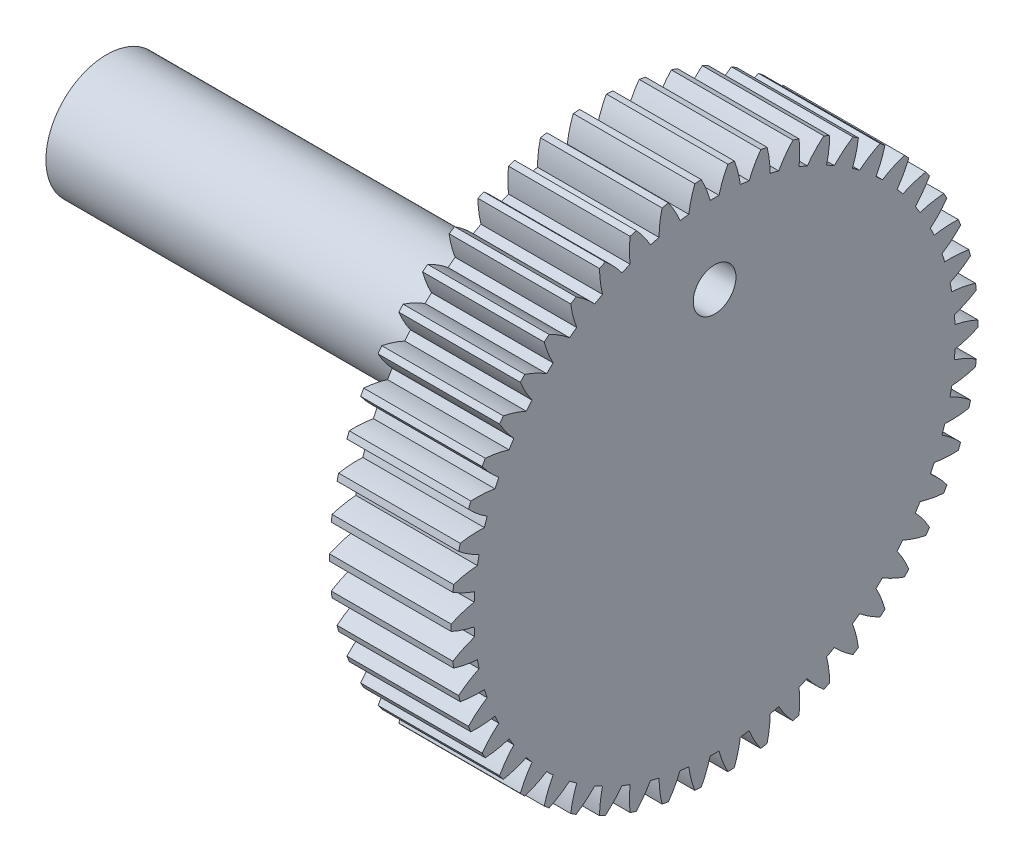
from build123d import *

# Parameters (mm, degrees)
BASPROSKE_W             = 12
BASPROSKE_H             = 26
TOOTHCUT_DEPTH          = 39.678159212
TEETHCUTS_COUNT         = 50
TEETHCUTS_ANGLE         = 352.8
BORSKE_R                = 0.4
BORE_DEPTH              = 50.0000508
ESQUISSE1_R             = 6
EXTRUSION1_DEPTH        = 60
ESQUISSE2_R             = 2.107583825
ENL_V_MAT_EXTRU_1_DEPTH = 71.358142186
ENL_V_MAT_EXTRU_2_DEPTH = 1


with BuildPart() as part:
    # BasProSke → Base-Revolve (revolve)
    with BuildSketch(Plane(origin=(0, 0, 0), x_dir=(1, 0, 0), z_dir=(0, 1, 0)), mode=Mode.PRIVATE) as base_revolve_sk:
        with Locations((6, 13)):
            Rectangle(BASPROSKE_W, BASPROSKE_H)
    revolve(base_revolve_sk.sketch.rotate(Axis((-10, 0, 0), (1, 0, 0)), 180), axis=Axis((-10, 0, 0), (1, 0, 0)))

    # TooCutSke → ToothCut (cut, through all)
    with BuildSketch(Plane(origin=(0, 0, 0), x_dir=(0, 0, -1), z_dir=(1, 0, 0))):
        with BuildLine():
            ThreePointArc((0.437663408, 23.744966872), (0, 23.749), (-0.437663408, 23.744966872))
            ThreePointArc((-0.437663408, 23.744966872), (-0.815428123, 24.895236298), (-1.329433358, 25.991422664))
            ThreePointArc((-1.329433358, 25.991422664), (0, 26.0254), (1.329433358, 25.991422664))
            ThreePointArc((1.329433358, 25.991422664), (0.815428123, 24.895236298), (0.437663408, 23.744966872))
        make_face()
    toothcut = extrude(amount=TOOTHCUT_DEPTH, mode=Mode.SUBTRACT)

    # TeethCuts: ToothCut ×50 about axis
    teethcuts_axis = Axis((-10, 0, 0), (1, 0, 0))
    for i in range(1, TEETHCUTS_COUNT):
        add(toothcut.rotate(teethcuts_axis, i * TEETHCUTS_ANGLE / (TEETHCUTS_COUNT - 1)), mode=Mode.SUBTRACT)

    # BorSke → Bore (cut, symmetric)
    with BuildSketch(Plane(origin=(0, 0, 0), x_dir=(0, 0, -1), z_dir=(1, 0, 0))):
        with Locations(Location((0, 0, 0), (0, 0, 180))):
            Circle(BORSKE_R)
    extrude(amount=BORE_DEPTH, both=True, mode=Mode.SUBTRACT)

    # Esquisse1 → Extrusion1 (add)
    with BuildSketch(Plane(origin=(12, 0, 0), x_dir=(0, 0, -1), z_dir=(1, 0, 0))):
        Circle(ESQUISSE1_R)
    extrude(amount=-EXTRUSION1_DEPTH)

    # Esquisse2 → Enl_v. mat.-Extru.1 (cut, through all)
    with BuildSketch(Plane(origin=(12, 0, 0), x_dir=(0, 0, -1), z_dir=(1, 0, 0))):
        with Locations((0, 15.921952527)):
            Circle(ESQUISSE2_R)
    extrude(amount=-ENL_V_MAT_EXTRU_1_DEPTH, mode=Mode.SUBTRACT)

    # Esquisse3 → Enl_v. mat.-Extru.2 (cut)
    with BuildSketch(Plane.ZY):
        with BuildLine():
            Line((-1.437253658, 11.245743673), (-2.007125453, 11.245743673))
            add(Edge.make_bspline(
                [(-2.007125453, 11.245743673), (-2.003411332, 11.32134657), (-1.996116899, 11.469828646), (-1.961957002, 11.686316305), (-1.913078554, 11.893244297), (-1.843969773, 12.088951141), (-1.758142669, 12.275167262), (-1.655218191, 12.451153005), (-1.533309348, 12.616237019), (-1.395048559, 12.76888892), (-1.244882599, 12.908929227), (-1.082856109, 13.029860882), (-0.912594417, 13.132037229), (-0.734614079, 13.217456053), (-0.546907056, 13.281572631), (-0.351176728, 13.329146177), (-0.146563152, 13.357768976), (-0.007153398, 13.360845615), (0.063747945, 13.36241034)],
                knots=[0, 0, 0, 0, 1.10065271, 2.161652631, 3.183658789, 4.190468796, 5.17591951, 6.163126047, 7.15150782, 8.156236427, 9.156009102, 10.134482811, 11.092018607, 12.041330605, 13.001268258, 13.972401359, 14.968799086, 16, 16, 16, 16], degree=3))
            add(Edge.make_bspline(
                [(0.063747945, 13.36241034), (0.133376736, 13.360780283), (0.270194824, 13.35757728), (0.469878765, 13.330070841), (0.659974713, 13.286989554), (0.84011109, 13.22654587), (1.008850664, 13.145294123), (1.167461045, 13.047690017), (1.317830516, 12.934805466), (1.453188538, 12.801902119), (1.577481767, 12.66002065), (1.684710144, 12.508549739), (1.776536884, 12.352105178), (1.853077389, 12.189494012), (1.909422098, 12.019185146), (1.952199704, 11.843658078), (1.97637944, 11.661095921), (1.980090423, 11.53753117), (1.981977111, 11.474710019)],
                knots=[0, 0, 0, 0, 1.111607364, 2.184268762, 3.212621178, 4.221274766, 5.211760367, 6.196651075, 7.1921475, 8.207485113, 9.220403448, 10.201281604, 11.166441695, 12.114753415, 13.065576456, 14.026450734, 14.996634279, 16, 16, 16, 16], degree=3))
            add(Edge.make_bspline(
                [(1.981977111, 11.474710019), (1.978905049, 11.38626752), (1.972814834, 11.210934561), (1.920718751, 10.953279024), (1.839354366, 10.703645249), (1.741387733, 10.502736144), (1.642559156, 10.340841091), (1.553500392, 10.207547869), (1.449242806, 10.064027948), (1.32826896, 9.910761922), (1.193081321, 9.74654928), (1.042455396, 9.571489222), (0.875317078, 9.38739044), (0.758008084, 9.261650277), (0.697221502, 9.196494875)],
                knots=[0, 0, 0, 0, 1.184426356, 2.348067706, 3.509069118, 4.696110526, 5.333549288, 6.050745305, 6.844228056, 7.710549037, 8.667450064, 9.695053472, 10.805634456, 12, 12, 12, 12], degree=3))
            Line((0.697221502, 9.196494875), (-0.891550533, 7.500871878))
            Line((-0.891550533, 7.500871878), (2.063387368, 7.500871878))
            Line((2.063387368, 7.500871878), (2.063387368, 6.849589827))
            Line((2.063387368, 6.849589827), (-2.251356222, 6.849589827))
            Line((-2.251356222, 6.849589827), (0.211304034, 9.477614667))
            add(Edge.make_bspline(
                [(0.211304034, 9.477614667), (0.271262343, 9.540204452), (0.386429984, 9.660426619), (0.54932123, 9.835945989), (0.695623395, 9.998777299), (0.826283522, 10.148612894), (0.938467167, 10.287644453), (1.038021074, 10.411369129), (1.117787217, 10.525223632), (1.204356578, 10.657195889), (1.288201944, 10.818326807), (1.360251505, 11.015237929), (1.404184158, 11.217943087), (1.40945436, 11.354925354), (1.412105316, 11.423828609)],
                knots=[0, 0, 0, 0, 1.329631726, 2.553950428, 3.673215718, 4.687767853, 5.603093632, 6.413772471, 7.123043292, 7.734684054, 8.834405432, 9.900288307, 10.943827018, 12, 12, 12, 12], degree=3))
            add(Edge.make_bspline(
                [(1.412105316, 11.423828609), (1.410951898, 11.467156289), (1.408678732, 11.552546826), (1.38861691, 11.677742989), (1.358299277, 11.79851058), (1.314855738, 11.915221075), (1.257512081, 12.026701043), (1.187710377, 12.133086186), (1.107174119, 12.235936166), (1.014008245, 12.332371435), (0.91166163, 12.420693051), (0.803540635, 12.498932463), (0.689149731, 12.564317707), (0.568971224, 12.617918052), (0.443340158, 12.659964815), (0.312013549, 12.689099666), (0.175354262, 12.707392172), (0.082039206, 12.70986717), (0.034491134, 12.711128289)],
                knots=[0, 0, 0, 0, 0.991446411, 1.95395049, 2.89581595, 3.838931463, 4.798493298, 5.75982156, 6.748411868, 7.785213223, 8.824556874, 9.840280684, 10.836137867, 11.835679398, 12.848801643, 13.863922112, 14.911575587, 16, 16, 16, 16], degree=3))
            add(Edge.make_bspline(
                [(0.034491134, 12.711128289), (-0.015167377, 12.709831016), (-0.112688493, 12.707283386), (-0.255870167, 12.689462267), (-0.392460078, 12.658717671), (-0.522801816, 12.616668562), (-0.647115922, 12.563222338), (-0.76479783, 12.496653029), (-0.875583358, 12.417217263), (-0.979680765, 12.327155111), (-1.075591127, 12.226883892), (-1.15985903, 12.115105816), (-1.233490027, 11.993861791), (-1.297732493, 11.863478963), (-1.349903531, 11.722774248), (-1.389769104, 11.572247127), (-1.421313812, 11.412551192), (-1.431852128, 11.302269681), (-1.437253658, 11.245743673)],
                knots=[0, 0, 0, 0, 1.031018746, 2.02475058, 2.990194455, 3.934040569, 4.864654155, 5.795059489, 6.735614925, 7.690564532, 8.649604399, 9.611025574, 10.590972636, 11.591080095, 12.624614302, 13.701020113, 14.821632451, 16, 16, 16, 16], degree=3))
        make_face()
    extrude(amount=-ENL_V_MAT_EXTRU_2_DEPTH, mode=Mode.SUBTRACT)


solid = part.part
